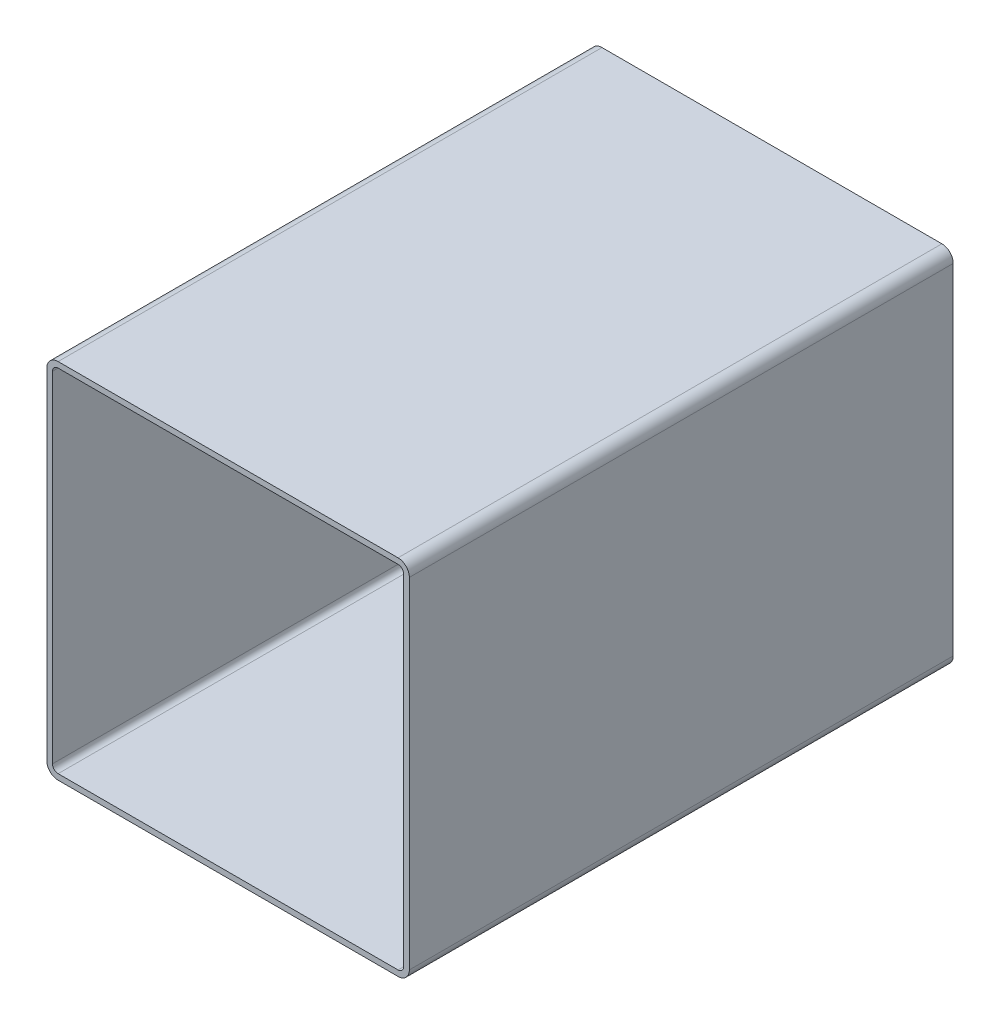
ISO-10303-21;
HEADER;
FILE_DESCRIPTION(('STEP AP214'),'2;1');
FILE_NAME('part.step','',(''),(''),'','','');
FILE_SCHEMA(('AUTOMOTIVE_DESIGN { 1 0 10303 214 1 1 1 1 }'));
ENDSEC;
DATA;
#1=APPLICATION_CONTEXT('core data for automotive mechanical design processes');
#2=APPLICATION_PROTOCOL_DEFINITION('international standard','automotive_design',2000,#1);
#3=PRODUCT_CONTEXT('',#1,'mechanical');
#4=PRODUCT('Part','Part','',(#3));
#5=PRODUCT_RELATED_PRODUCT_CATEGORY('part','',(#4));
#6=PRODUCT_DEFINITION_FORMATION('','',#4);
#7=PRODUCT_DEFINITION_CONTEXT('part definition',#1,'design');
#8=PRODUCT_DEFINITION('design','',#6,#7);
#9=PRODUCT_DEFINITION_SHAPE('','',#8);
#10=(LENGTH_UNIT() NAMED_UNIT(*) SI_UNIT(.MILLI.,.METRE.));
#11=(NAMED_UNIT(*) PLANE_ANGLE_UNIT() SI_UNIT($,.RADIAN.));
#12=(NAMED_UNIT(*) SI_UNIT($,.STERADIAN.) SOLID_ANGLE_UNIT());
#13=UNCERTAINTY_MEASURE_WITH_UNIT(LENGTH_MEASURE(1.E-05),#10,'distance_accuracy_value','');
#14=(GEOMETRIC_REPRESENTATION_CONTEXT(3) GLOBAL_UNCERTAINTY_ASSIGNED_CONTEXT((#13)) GLOBAL_UNIT_ASSIGNED_CONTEXT((#10,
#11,#12)) REPRESENTATION_CONTEXT('',''));
#15=CARTESIAN_POINT('',(0.,0.,0.));
#16=DIRECTION('',(0.,0.,1.));
#17=DIRECTION('',(1.,0.,0.));
#18=AXIS2_PLACEMENT_3D('',#15,#16,#17);
#19=CARTESIAN_POINT('',(7.7409404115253,198.816130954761,304.8));
#20=DIRECTION('',(0.,0.,1.));
#21=DIRECTION('',(1.,0.,0.));
#22=AXIS2_PLACEMENT_3D('',#19,#20,#21);
#23=PLANE('',#22);
#24=CARTESIAN_POINT('',(7.7409404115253,198.816130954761,304.8));
#25=DIRECTION('',(0.,0.,1.));
#26=DIRECTION('',(1.,0.,0.));
#27=AXIS2_PLACEMENT_3D('',#24,#25,#26);
#28=CIRCLE('',#27,6.35);
#29=CARTESIAN_POINT('',(7.7409404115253,205.166130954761,304.8));
#30=VERTEX_POINT('',#29);
#31=CARTESIAN_POINT('',(1.3909404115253,198.816130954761,304.8));
#32=VERTEX_POINT('',#31);
#33=EDGE_CURVE('E211',#30,#32,#28,.T.);
#34=ORIENTED_EDGE('',*,*,#33,.T.);
#35=DIRECTION('',(0.,-1.,0.));
#36=VECTOR('',#35,1.);
#37=CARTESIAN_POINT('',(1.3909404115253,8.31613095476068,304.8));
#38=LINE('',#37,#36);
#39=CARTESIAN_POINT('',(1.3909404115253,8.31613095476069,304.8));
#40=VERTEX_POINT('',#39);
#41=EDGE_CURVE('E214',#32,#40,#38,.T.);
#42=ORIENTED_EDGE('',*,*,#41,.T.);
#43=CARTESIAN_POINT('',(7.7409404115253,8.31613095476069,304.8));
#44=DIRECTION('',(0.,0.,1.));
#45=DIRECTION('',(1.,0.,0.));
#46=AXIS2_PLACEMENT_3D('',#43,#44,#45);
#47=CIRCLE('',#46,6.35);
#48=CARTESIAN_POINT('',(7.7409404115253,1.96613095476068,304.8));
#49=VERTEX_POINT('',#48);
#50=EDGE_CURVE('E217',#40,#49,#47,.T.);
#51=ORIENTED_EDGE('',*,*,#50,.T.);
#52=DIRECTION('',(1.,0.,0.));
#53=VECTOR('',#52,1.);
#54=CARTESIAN_POINT('',(198.240940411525,1.96613095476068,304.8));
#55=LINE('',#54,#53);
#56=CARTESIAN_POINT('',(198.240940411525,1.96613095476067,304.8));
#57=VERTEX_POINT('',#56);
#58=EDGE_CURVE('E219',#49,#57,#55,.T.);
#59=ORIENTED_EDGE('',*,*,#58,.T.);
#60=CARTESIAN_POINT('',(198.240940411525,8.31613095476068,304.8));
#61=DIRECTION('',(0.,0.,1.));
#62=DIRECTION('',(1.,0.,0.));
#63=AXIS2_PLACEMENT_3D('',#60,#61,#62);
#64=CIRCLE('',#63,6.35000000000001);
#65=CARTESIAN_POINT('',(204.590940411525,8.31613095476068,304.8));
#66=VERTEX_POINT('',#65);
#67=EDGE_CURVE('E221',#57,#66,#64,.T.);
#68=ORIENTED_EDGE('',*,*,#67,.T.);
#69=DIRECTION('',(0.,1.,0.));
#70=VECTOR('',#69,1.);
#71=CARTESIAN_POINT('',(204.590940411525,198.816130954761,304.8));
#72=LINE('',#71,#70);
#73=CARTESIAN_POINT('',(204.590940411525,198.816130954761,304.8));
#74=VERTEX_POINT('',#73);
#75=EDGE_CURVE('E223',#66,#74,#72,.T.);
#76=ORIENTED_EDGE('',*,*,#75,.T.);
#77=CARTESIAN_POINT('',(198.240940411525,198.816130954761,304.8));
#78=DIRECTION('',(0.,0.,1.));
#79=DIRECTION('',(1.,0.,0.));
#80=AXIS2_PLACEMENT_3D('',#77,#78,#79);
#81=CIRCLE('',#80,6.35000000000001);
#82=CARTESIAN_POINT('',(198.240940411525,205.166130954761,304.8));
#83=VERTEX_POINT('',#82);
#84=EDGE_CURVE('E225',#74,#83,#81,.T.);
#85=ORIENTED_EDGE('',*,*,#84,.T.);
#86=DIRECTION('',(-1.,0.,0.));
#87=VECTOR('',#86,1.);
#88=CARTESIAN_POINT('',(7.7409404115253,205.166130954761,304.8));
#89=LINE('',#88,#87);
#90=EDGE_CURVE('E227',#83,#30,#89,.T.);
#91=ORIENTED_EDGE('',*,*,#90,.T.);
#92=EDGE_LOOP('',(#34,#42,#51,#59,#68,#76,#85,#91));
#93=FACE_BOUND('',#92,.T.);
#94=DIRECTION('',(0.,-1.,0.));
#95=VECTOR('',#94,1.);
#96=CARTESIAN_POINT('',(4.5659404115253,8.31613095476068,304.8));
#97=LINE('',#96,#95);
#98=CARTESIAN_POINT('',(4.5659404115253,198.816130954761,304.8));
#99=VERTEX_POINT('',#98);
#100=CARTESIAN_POINT('',(4.5659404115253,8.31613095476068,304.8));
#101=VERTEX_POINT('',#100);
#102=EDGE_CURVE('E154',#99,#101,#97,.T.);
#103=ORIENTED_EDGE('',*,*,#102,.F.);
#104=CARTESIAN_POINT('',(7.7409404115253,198.816130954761,304.8));
#105=DIRECTION('',(0.,0.,1.));
#106=DIRECTION('',(1.,0.,0.));
#107=AXIS2_PLACEMENT_3D('',#104,#105,#106);
#108=CIRCLE('',#107,3.17499999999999);
#109=CARTESIAN_POINT('',(7.7409404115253,201.991130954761,304.8));
#110=VERTEX_POINT('',#109);
#111=EDGE_CURVE('E146',#110,#99,#108,.T.);
#112=ORIENTED_EDGE('',*,*,#111,.F.);
#113=DIRECTION('',(-1.,0.,0.));
#114=VECTOR('',#113,1.);
#115=CARTESIAN_POINT('',(7.7409404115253,201.991130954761,304.8));
#116=LINE('',#115,#114);
#117=CARTESIAN_POINT('',(198.240940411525,201.991130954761,304.8));
#118=VERTEX_POINT('',#117);
#119=EDGE_CURVE('E179',#118,#110,#116,.T.);
#120=ORIENTED_EDGE('',*,*,#119,.F.);
#121=CARTESIAN_POINT('',(198.240940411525,198.816130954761,304.8));
#122=DIRECTION('',(0.,0.,1.));
#123=DIRECTION('',(1.,0.,0.));
#124=AXIS2_PLACEMENT_3D('',#121,#122,#123);
#125=CIRCLE('',#124,3.175);
#126=CARTESIAN_POINT('',(201.415940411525,198.816130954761,304.8));
#127=VERTEX_POINT('',#126);
#128=EDGE_CURVE('E177',#127,#118,#125,.T.);
#129=ORIENTED_EDGE('',*,*,#128,.F.);
#130=DIRECTION('',(0.,1.,0.));
#131=VECTOR('',#130,1.);
#132=CARTESIAN_POINT('',(201.415940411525,198.816130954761,304.8));
#133=LINE('',#132,#131);
#134=CARTESIAN_POINT('',(201.415940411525,8.31613095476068,304.8));
#135=VERTEX_POINT('',#134);
#136=EDGE_CURVE('E175',#135,#127,#133,.T.);
#137=ORIENTED_EDGE('',*,*,#136,.F.);
#138=CARTESIAN_POINT('',(198.240940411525,8.31613095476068,304.8));
#139=DIRECTION('',(0.,0.,1.));
#140=DIRECTION('',(1.,0.,0.));
#141=AXIS2_PLACEMENT_3D('',#138,#139,#140);
#142=CIRCLE('',#141,3.175);
#143=CARTESIAN_POINT('',(198.240940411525,5.14113095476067,304.8));
#144=VERTEX_POINT('',#143);
#145=EDGE_CURVE('E173',#144,#135,#142,.T.);
#146=ORIENTED_EDGE('',*,*,#145,.F.);
#147=DIRECTION('',(1.,0.,0.));
#148=VECTOR('',#147,1.);
#149=CARTESIAN_POINT('',(198.240940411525,5.14113095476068,304.8));
#150=LINE('',#149,#148);
#151=CARTESIAN_POINT('',(7.7409404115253,5.14113095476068,304.8));
#152=VERTEX_POINT('',#151);
#153=EDGE_CURVE('E169',#152,#144,#150,.T.);
#154=ORIENTED_EDGE('',*,*,#153,.F.);
#155=CARTESIAN_POINT('',(7.7409404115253,8.31613095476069,304.8));
#156=DIRECTION('',(0.,0.,1.));
#157=DIRECTION('',(1.,0.,0.));
#158=AXIS2_PLACEMENT_3D('',#155,#156,#157);
#159=CIRCLE('',#158,3.175);
#160=EDGE_CURVE('E167',#101,#152,#159,.T.);
#161=ORIENTED_EDGE('',*,*,#160,.F.);
#162=EDGE_LOOP('',(#103,#112,#120,#129,#137,#146,#154,#161));
#163=FACE_BOUND('',#162,.T.);
#164=ADVANCED_FACE('F33',(#93,#163),#23,.T.);
#165=CARTESIAN_POINT('',(7.7409404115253,198.816130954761,0.));
#166=DIRECTION('',(0.,0.,1.));
#167=DIRECTION('',(1.,0.,0.));
#168=AXIS2_PLACEMENT_3D('',#165,#166,#167);
#169=PLANE('',#168);
#170=CARTESIAN_POINT('',(7.7409404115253,198.816130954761,0.));
#171=DIRECTION('',(0.,0.,1.));
#172=DIRECTION('',(1.,0.,0.));
#173=AXIS2_PLACEMENT_3D('',#170,#171,#172);
#174=CIRCLE('',#173,6.35);
#175=CARTESIAN_POINT('',(7.7409404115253,205.166130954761,0.));
#176=VERTEX_POINT('',#175);
#177=CARTESIAN_POINT('',(1.3909404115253,198.816130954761,0.));
#178=VERTEX_POINT('',#177);
#179=EDGE_CURVE('E162',#176,#178,#174,.T.);
#180=ORIENTED_EDGE('',*,*,#179,.F.);
#181=DIRECTION('',(-1.,0.,0.));
#182=VECTOR('',#181,1.);
#183=CARTESIAN_POINT('',(7.7409404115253,205.166130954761,0.));
#184=LINE('',#183,#182);
#185=CARTESIAN_POINT('',(198.240940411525,205.166130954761,0.));
#186=VERTEX_POINT('',#185);
#187=EDGE_CURVE('E215',#186,#176,#184,.T.);
#188=ORIENTED_EDGE('',*,*,#187,.F.);
#189=CARTESIAN_POINT('',(198.240940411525,198.816130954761,0.));
#190=DIRECTION('',(0.,0.,1.));
#191=DIRECTION('',(1.,0.,0.));
#192=AXIS2_PLACEMENT_3D('',#189,#190,#191);
#193=CIRCLE('',#192,6.35000000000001);
#194=CARTESIAN_POINT('',(204.590940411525,198.816130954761,0.));
#195=VERTEX_POINT('',#194);
#196=EDGE_CURVE('E242',#195,#186,#193,.T.);
#197=ORIENTED_EDGE('',*,*,#196,.F.);
#198=DIRECTION('',(0.,1.,0.));
#199=VECTOR('',#198,1.);
#200=CARTESIAN_POINT('',(204.590940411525,198.816130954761,0.));
#201=LINE('',#200,#199);
#202=CARTESIAN_POINT('',(204.590940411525,8.31613095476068,0.));
#203=VERTEX_POINT('',#202);
#204=EDGE_CURVE('E240',#203,#195,#201,.T.);
#205=ORIENTED_EDGE('',*,*,#204,.F.);
#206=CARTESIAN_POINT('',(198.240940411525,8.31613095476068,0.));
#207=DIRECTION('',(0.,0.,1.));
#208=DIRECTION('',(1.,0.,0.));
#209=AXIS2_PLACEMENT_3D('',#206,#207,#208);
#210=CIRCLE('',#209,6.35000000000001);
#211=CARTESIAN_POINT('',(198.240940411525,1.96613095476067,0.));
#212=VERTEX_POINT('',#211);
#213=EDGE_CURVE('E238',#212,#203,#210,.T.);
#214=ORIENTED_EDGE('',*,*,#213,.F.);
#215=DIRECTION('',(1.,0.,0.));
#216=VECTOR('',#215,1.);
#217=CARTESIAN_POINT('',(198.240940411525,1.96613095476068,0.));
#218=LINE('',#217,#216);
#219=CARTESIAN_POINT('',(7.7409404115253,1.96613095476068,0.));
#220=VERTEX_POINT('',#219);
#221=EDGE_CURVE('E236',#220,#212,#218,.T.);
#222=ORIENTED_EDGE('',*,*,#221,.F.);
#223=CARTESIAN_POINT('',(7.7409404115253,8.31613095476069,0.));
#224=DIRECTION('',(0.,0.,1.));
#225=DIRECTION('',(1.,0.,0.));
#226=AXIS2_PLACEMENT_3D('',#223,#224,#225);
#227=CIRCLE('',#226,6.35);
#228=CARTESIAN_POINT('',(1.3909404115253,8.31613095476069,0.));
#229=VERTEX_POINT('',#228);
#230=EDGE_CURVE('E234',#229,#220,#227,.T.);
#231=ORIENTED_EDGE('',*,*,#230,.F.);
#232=DIRECTION('',(0.,-1.,0.));
#233=VECTOR('',#232,1.);
#234=CARTESIAN_POINT('',(1.3909404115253,8.31613095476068,0.));
#235=LINE('',#234,#233);
#236=EDGE_CURVE('E232',#178,#229,#235,.T.);
#237=ORIENTED_EDGE('',*,*,#236,.F.);
#238=EDGE_LOOP('',(#180,#188,#197,#205,#214,#222,#231,#237));
#239=FACE_BOUND('',#238,.T.);
#240=CARTESIAN_POINT('',(7.7409404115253,198.816130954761,0.));
#241=DIRECTION('',(0.,0.,1.));
#242=DIRECTION('',(1.,0.,0.));
#243=AXIS2_PLACEMENT_3D('',#240,#241,#242);
#244=CIRCLE('',#243,3.17499999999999);
#245=CARTESIAN_POINT('',(7.7409404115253,201.991130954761,0.));
#246=VERTEX_POINT('',#245);
#247=CARTESIAN_POINT('',(4.5659404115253,198.816130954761,0.));
#248=VERTEX_POINT('',#247);
#249=EDGE_CURVE('E56',#246,#248,#244,.T.);
#250=ORIENTED_EDGE('',*,*,#249,.T.);
#251=DIRECTION('',(0.,-1.,0.));
#252=VECTOR('',#251,1.);
#253=CARTESIAN_POINT('',(4.5659404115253,8.31613095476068,0.));
#254=LINE('',#253,#252);
#255=CARTESIAN_POINT('',(4.5659404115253,8.31613095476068,0.));
#256=VERTEX_POINT('',#255);
#257=EDGE_CURVE('E161',#248,#256,#254,.T.);
#258=ORIENTED_EDGE('',*,*,#257,.T.);
#259=CARTESIAN_POINT('',(7.7409404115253,8.31613095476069,0.));
#260=DIRECTION('',(0.,0.,1.));
#261=DIRECTION('',(1.,0.,0.));
#262=AXIS2_PLACEMENT_3D('',#259,#260,#261);
#263=CIRCLE('',#262,3.175);
#264=CARTESIAN_POINT('',(7.7409404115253,5.14113095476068,0.));
#265=VERTEX_POINT('',#264);
#266=EDGE_CURVE('E183',#256,#265,#263,.T.);
#267=ORIENTED_EDGE('',*,*,#266,.T.);
#268=DIRECTION('',(1.,0.,0.));
#269=VECTOR('',#268,1.);
#270=CARTESIAN_POINT('',(198.240940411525,5.14113095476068,0.));
#271=LINE('',#270,#269);
#272=CARTESIAN_POINT('',(198.240940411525,5.14113095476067,0.));
#273=VERTEX_POINT('',#272);
#274=EDGE_CURVE('E186',#265,#273,#271,.T.);
#275=ORIENTED_EDGE('',*,*,#274,.T.);
#276=CARTESIAN_POINT('',(198.240940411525,8.31613095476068,0.));
#277=DIRECTION('',(0.,0.,1.));
#278=DIRECTION('',(1.,0.,0.));
#279=AXIS2_PLACEMENT_3D('',#276,#277,#278);
#280=CIRCLE('',#279,3.175);
#281=CARTESIAN_POINT('',(201.415940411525,8.31613095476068,0.));
#282=VERTEX_POINT('',#281);
#283=EDGE_CURVE('E189',#273,#282,#280,.T.);
#284=ORIENTED_EDGE('',*,*,#283,.T.);
#285=DIRECTION('',(0.,1.,0.));
#286=VECTOR('',#285,1.);
#287=CARTESIAN_POINT('',(201.415940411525,198.816130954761,0.));
#288=LINE('',#287,#286);
#289=CARTESIAN_POINT('',(201.415940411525,198.816130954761,0.));
#290=VERTEX_POINT('',#289);
#291=EDGE_CURVE('E192',#282,#290,#288,.T.);
#292=ORIENTED_EDGE('',*,*,#291,.T.);
#293=CARTESIAN_POINT('',(198.240940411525,198.816130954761,0.));
#294=DIRECTION('',(0.,0.,1.));
#295=DIRECTION('',(1.,0.,0.));
#296=AXIS2_PLACEMENT_3D('',#293,#294,#295);
#297=CIRCLE('',#296,3.175);
#298=CARTESIAN_POINT('',(198.240940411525,201.991130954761,0.));
#299=VERTEX_POINT('',#298);
#300=EDGE_CURVE('E195',#290,#299,#297,.T.);
#301=ORIENTED_EDGE('',*,*,#300,.T.);
#302=DIRECTION('',(-1.,0.,0.));
#303=VECTOR('',#302,1.);
#304=CARTESIAN_POINT('',(7.7409404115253,201.991130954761,0.));
#305=LINE('',#304,#303);
#306=EDGE_CURVE('E155',#299,#246,#305,.T.);
#307=ORIENTED_EDGE('',*,*,#306,.T.);
#308=EDGE_LOOP('',(#250,#258,#267,#275,#284,#292,#301,#307));
#309=FACE_BOUND('',#308,.T.);
#310=ADVANCED_FACE('F272',(#239,#309),#169,.F.);
#311=CARTESIAN_POINT('',(7.7409404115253,198.816130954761,304.8));
#312=DIRECTION('',(0.,0.,-1.));
#313=DIRECTION('',(-1.,0.,0.));
#314=AXIS2_PLACEMENT_3D('',#311,#312,#313);
#315=CYLINDRICAL_SURFACE('',#314,6.35);
#316=ORIENTED_EDGE('',*,*,#179,.T.);
#317=DIRECTION('',(0.,0.,-1.));
#318=VECTOR('',#317,1.);
#319=CARTESIAN_POINT('',(1.3909404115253,198.816130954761,304.8));
#320=LINE('',#319,#318);
#321=EDGE_CURVE('E11',#32,#178,#320,.T.);
#322=ORIENTED_EDGE('',*,*,#321,.F.);
#323=ORIENTED_EDGE('',*,*,#33,.F.);
#324=DIRECTION('',(0.,0.,-1.));
#325=VECTOR('',#324,1.);
#326=CARTESIAN_POINT('',(7.7409404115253,205.166130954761,304.8));
#327=LINE('',#326,#325);
#328=EDGE_CURVE('E229',#30,#176,#327,.T.);
#329=ORIENTED_EDGE('',*,*,#328,.T.);
#330=EDGE_LOOP('',(#316,#322,#323,#329));
#331=FACE_BOUND('',#330,.T.);
#332=ADVANCED_FACE('F35',(#331),#315,.T.);
#333=CARTESIAN_POINT('',(1.3909404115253,8.31613095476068,304.8));
#334=DIRECTION('',(1.,0.,0.));
#335=DIRECTION('',(0.,0.,-1.));
#336=AXIS2_PLACEMENT_3D('',#333,#334,#335);
#337=PLANE('',#336);
#338=ORIENTED_EDGE('',*,*,#236,.T.);
#339=DIRECTION('',(0.,0.,-1.));
#340=VECTOR('',#339,1.);
#341=CARTESIAN_POINT('',(1.3909404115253,8.31613095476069,304.8));
#342=LINE('',#341,#340);
#343=EDGE_CURVE('E41',#40,#229,#342,.T.);
#344=ORIENTED_EDGE('',*,*,#343,.F.);
#345=ORIENTED_EDGE('',*,*,#41,.F.);
#346=ORIENTED_EDGE('',*,*,#321,.T.);
#347=EDGE_LOOP('',(#338,#344,#345,#346));
#348=FACE_BOUND('',#347,.T.);
#349=ADVANCED_FACE('F289',(#348),#337,.F.);
#350=CARTESIAN_POINT('',(7.7409404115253,8.31613095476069,304.8));
#351=DIRECTION('',(0.,0.,-1.));
#352=DIRECTION('',(-1.,0.,0.));
#353=AXIS2_PLACEMENT_3D('',#350,#351,#352);
#354=CYLINDRICAL_SURFACE('',#353,6.35);
#355=ORIENTED_EDGE('',*,*,#230,.T.);
#356=DIRECTION('',(0.,0.,-1.));
#357=VECTOR('',#356,1.);
#358=CARTESIAN_POINT('',(7.7409404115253,1.96613095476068,304.8));
#359=LINE('',#358,#357);
#360=EDGE_CURVE('E259',#49,#220,#359,.T.);
#361=ORIENTED_EDGE('',*,*,#360,.F.);
#362=ORIENTED_EDGE('',*,*,#50,.F.);
#363=ORIENTED_EDGE('',*,*,#343,.T.);
#364=EDGE_LOOP('',(#355,#361,#362,#363));
#365=FACE_BOUND('',#364,.T.);
#366=ADVANCED_FACE('F266',(#365),#354,.T.);
#367=CARTESIAN_POINT('',(198.240940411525,1.96613095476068,304.8));
#368=DIRECTION('',(0.,1.,0.));
#369=DIRECTION('',(0.,0.,1.));
#370=AXIS2_PLACEMENT_3D('',#367,#368,#369);
#371=PLANE('',#370);
#372=ORIENTED_EDGE('',*,*,#221,.T.);
#373=DIRECTION('',(0.,0.,-1.));
#374=VECTOR('',#373,1.);
#375=CARTESIAN_POINT('',(198.240940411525,1.96613095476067,304.8));
#376=LINE('',#375,#374);
#377=EDGE_CURVE('E256',#57,#212,#376,.T.);
#378=ORIENTED_EDGE('',*,*,#377,.F.);
#379=ORIENTED_EDGE('',*,*,#58,.F.);
#380=ORIENTED_EDGE('',*,*,#360,.T.);
#381=EDGE_LOOP('',(#372,#378,#379,#380));
#382=FACE_BOUND('',#381,.T.);
#383=ADVANCED_FACE('F278',(#382),#371,.F.);
#384=CARTESIAN_POINT('',(198.240940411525,8.31613095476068,304.8));
#385=DIRECTION('',(0.,0.,-1.));
#386=DIRECTION('',(-1.,0.,0.));
#387=AXIS2_PLACEMENT_3D('',#384,#385,#386);
#388=CYLINDRICAL_SURFACE('',#387,6.35000000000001);
#389=ORIENTED_EDGE('',*,*,#213,.T.);
#390=DIRECTION('',(0.,0.,-1.));
#391=VECTOR('',#390,1.);
#392=CARTESIAN_POINT('',(204.590940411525,8.31613095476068,304.8));
#393=LINE('',#392,#391);
#394=EDGE_CURVE('E253',#66,#203,#393,.T.);
#395=ORIENTED_EDGE('',*,*,#394,.F.);
#396=ORIENTED_EDGE('',*,*,#67,.F.);
#397=ORIENTED_EDGE('',*,*,#377,.T.);
#398=EDGE_LOOP('',(#389,#395,#396,#397));
#399=FACE_BOUND('',#398,.T.);
#400=ADVANCED_FACE('F282',(#399),#388,.T.);
#401=CARTESIAN_POINT('',(204.590940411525,198.816130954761,304.8));
#402=DIRECTION('',(-1.,0.,0.));
#403=DIRECTION('',(0.,0.,1.));
#404=AXIS2_PLACEMENT_3D('',#401,#402,#403);
#405=PLANE('',#404);
#406=ORIENTED_EDGE('',*,*,#204,.T.);
#407=DIRECTION('',(0.,0.,-1.));
#408=VECTOR('',#407,1.);
#409=CARTESIAN_POINT('',(204.590940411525,198.816130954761,304.8));
#410=LINE('',#409,#408);
#411=EDGE_CURVE('E250',#74,#195,#410,.T.);
#412=ORIENTED_EDGE('',*,*,#411,.F.);
#413=ORIENTED_EDGE('',*,*,#75,.F.);
#414=ORIENTED_EDGE('',*,*,#394,.T.);
#415=EDGE_LOOP('',(#406,#412,#413,#414));
#416=FACE_BOUND('',#415,.T.);
#417=ADVANCED_FACE('F302',(#416),#405,.F.);
#418=CARTESIAN_POINT('',(198.240940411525,198.816130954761,304.8));
#419=DIRECTION('',(0.,0.,-1.));
#420=DIRECTION('',(-1.,0.,0.));
#421=AXIS2_PLACEMENT_3D('',#418,#419,#420);
#422=CYLINDRICAL_SURFACE('',#421,6.35000000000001);
#423=ORIENTED_EDGE('',*,*,#196,.T.);
#424=DIRECTION('',(0.,0.,-1.));
#425=VECTOR('',#424,1.);
#426=CARTESIAN_POINT('',(198.240940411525,205.166130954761,304.8));
#427=LINE('',#426,#425);
#428=EDGE_CURVE('E247',#83,#186,#427,.T.);
#429=ORIENTED_EDGE('',*,*,#428,.F.);
#430=ORIENTED_EDGE('',*,*,#84,.F.);
#431=ORIENTED_EDGE('',*,*,#411,.T.);
#432=EDGE_LOOP('',(#423,#429,#430,#431));
#433=FACE_BOUND('',#432,.T.);
#434=ADVANCED_FACE('F300',(#433),#422,.T.);
#435=CARTESIAN_POINT('',(7.7409404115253,205.166130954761,304.8));
#436=DIRECTION('',(0.,-1.,0.));
#437=DIRECTION('',(0.,0.,-1.));
#438=AXIS2_PLACEMENT_3D('',#435,#436,#437);
#439=PLANE('',#438);
#440=ORIENTED_EDGE('',*,*,#187,.T.);
#441=ORIENTED_EDGE('',*,*,#328,.F.);
#442=ORIENTED_EDGE('',*,*,#90,.F.);
#443=ORIENTED_EDGE('',*,*,#428,.T.);
#444=EDGE_LOOP('',(#440,#441,#442,#443));
#445=FACE_BOUND('',#444,.T.);
#446=ADVANCED_FACE('F295',(#445),#439,.F.);
#447=CARTESIAN_POINT('',(7.7409404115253,198.816130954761,304.8));
#448=DIRECTION('',(0.,0.,-1.));
#449=DIRECTION('',(-1.,0.,0.));
#450=AXIS2_PLACEMENT_3D('',#447,#448,#449);
#451=CYLINDRICAL_SURFACE('',#450,3.17499999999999);
#452=ORIENTED_EDGE('',*,*,#249,.F.);
#453=DIRECTION('',(0.,0.,-1.));
#454=VECTOR('',#453,1.);
#455=CARTESIAN_POINT('',(7.7409404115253,201.991130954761,304.8));
#456=LINE('',#455,#454);
#457=EDGE_CURVE('E150',#110,#246,#456,.T.);
#458=ORIENTED_EDGE('',*,*,#457,.F.);
#459=ORIENTED_EDGE('',*,*,#111,.T.);
#460=DIRECTION('',(0.,0.,-1.));
#461=VECTOR('',#460,1.);
#462=CARTESIAN_POINT('',(4.5659404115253,198.816130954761,304.8));
#463=LINE('',#462,#461);
#464=EDGE_CURVE('E149',#99,#248,#463,.T.);
#465=ORIENTED_EDGE('',*,*,#464,.T.);
#466=EDGE_LOOP('',(#452,#458,#459,#465));
#467=FACE_BOUND('',#466,.T.);
#468=ADVANCED_FACE('F148',(#467),#451,.F.);
#469=CARTESIAN_POINT('',(4.5659404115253,8.31613095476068,304.8));
#470=DIRECTION('',(1.,0.,0.));
#471=DIRECTION('',(0.,0.,-1.));
#472=AXIS2_PLACEMENT_3D('',#469,#470,#471);
#473=PLANE('',#472);
#474=ORIENTED_EDGE('',*,*,#257,.F.);
#475=ORIENTED_EDGE('',*,*,#464,.F.);
#476=ORIENTED_EDGE('',*,*,#102,.T.);
#477=DIRECTION('',(0.,0.,-1.));
#478=VECTOR('',#477,1.);
#479=CARTESIAN_POINT('',(4.5659404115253,8.31613095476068,304.8));
#480=LINE('',#479,#478);
#481=EDGE_CURVE('E163',#101,#256,#480,.T.);
#482=ORIENTED_EDGE('',*,*,#481,.T.);
#483=EDGE_LOOP('',(#474,#475,#476,#482));
#484=FACE_BOUND('',#483,.T.);
#485=ADVANCED_FACE('F158',(#484),#473,.T.);
#486=CARTESIAN_POINT('',(7.7409404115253,8.31613095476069,304.8));
#487=DIRECTION('',(0.,0.,-1.));
#488=DIRECTION('',(-1.,0.,0.));
#489=AXIS2_PLACEMENT_3D('',#486,#487,#488);
#490=CYLINDRICAL_SURFACE('',#489,3.175);
#491=ORIENTED_EDGE('',*,*,#266,.F.);
#492=ORIENTED_EDGE('',*,*,#481,.F.);
#493=ORIENTED_EDGE('',*,*,#160,.T.);
#494=DIRECTION('',(0.,0.,-1.));
#495=VECTOR('',#494,1.);
#496=CARTESIAN_POINT('',(7.7409404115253,5.14113095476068,304.8));
#497=LINE('',#496,#495);
#498=EDGE_CURVE('E208',#152,#265,#497,.T.);
#499=ORIENTED_EDGE('',*,*,#498,.T.);
#500=EDGE_LOOP('',(#491,#492,#493,#499));
#501=FACE_BOUND('',#500,.T.);
#502=ADVANCED_FACE('F327',(#501),#490,.F.);
#503=CARTESIAN_POINT('',(198.240940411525,5.14113095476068,304.8));
#504=DIRECTION('',(0.,1.,0.));
#505=DIRECTION('',(0.,0.,1.));
#506=AXIS2_PLACEMENT_3D('',#503,#504,#505);
#507=PLANE('',#506);
#508=ORIENTED_EDGE('',*,*,#274,.F.);
#509=ORIENTED_EDGE('',*,*,#498,.F.);
#510=ORIENTED_EDGE('',*,*,#153,.T.);
#511=DIRECTION('',(0.,0.,-1.));
#512=VECTOR('',#511,1.);
#513=CARTESIAN_POINT('',(198.240940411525,5.14113095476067,304.8));
#514=LINE('',#513,#512);
#515=EDGE_CURVE('E206',#144,#273,#514,.T.);
#516=ORIENTED_EDGE('',*,*,#515,.T.);
#517=EDGE_LOOP('',(#508,#509,#510,#516));
#518=FACE_BOUND('',#517,.T.);
#519=ADVANCED_FACE('F331',(#518),#507,.T.);
#520=CARTESIAN_POINT('',(198.240940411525,8.31613095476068,304.8));
#521=DIRECTION('',(0.,0.,-1.));
#522=DIRECTION('',(-1.,0.,0.));
#523=AXIS2_PLACEMENT_3D('',#520,#521,#522);
#524=CYLINDRICAL_SURFACE('',#523,3.175);
#525=ORIENTED_EDGE('',*,*,#283,.F.);
#526=ORIENTED_EDGE('',*,*,#515,.F.);
#527=ORIENTED_EDGE('',*,*,#145,.T.);
#528=DIRECTION('',(0.,0.,-1.));
#529=VECTOR('',#528,1.);
#530=CARTESIAN_POINT('',(201.415940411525,8.31613095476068,304.8));
#531=LINE('',#530,#529);
#532=EDGE_CURVE('E204',#135,#282,#531,.T.);
#533=ORIENTED_EDGE('',*,*,#532,.T.);
#534=EDGE_LOOP('',(#525,#526,#527,#533));
#535=FACE_BOUND('',#534,.T.);
#536=ADVANCED_FACE('F337',(#535),#524,.F.);
#537=CARTESIAN_POINT('',(201.415940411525,198.816130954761,304.8));
#538=DIRECTION('',(-1.,0.,0.));
#539=DIRECTION('',(0.,0.,1.));
#540=AXIS2_PLACEMENT_3D('',#537,#538,#539);
#541=PLANE('',#540);
#542=ORIENTED_EDGE('',*,*,#291,.F.);
#543=ORIENTED_EDGE('',*,*,#532,.F.);
#544=ORIENTED_EDGE('',*,*,#136,.T.);
#545=DIRECTION('',(0.,0.,-1.));
#546=VECTOR('',#545,1.);
#547=CARTESIAN_POINT('',(201.415940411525,198.816130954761,304.8));
#548=LINE('',#547,#546);
#549=EDGE_CURVE('E202',#127,#290,#548,.T.);
#550=ORIENTED_EDGE('',*,*,#549,.T.);
#551=EDGE_LOOP('',(#542,#543,#544,#550));
#552=FACE_BOUND('',#551,.T.);
#553=ADVANCED_FACE('F341',(#552),#541,.T.);
#554=CARTESIAN_POINT('',(198.240940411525,198.816130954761,304.8));
#555=DIRECTION('',(0.,0.,-1.));
#556=DIRECTION('',(-1.,0.,0.));
#557=AXIS2_PLACEMENT_3D('',#554,#555,#556);
#558=CYLINDRICAL_SURFACE('',#557,3.175);
#559=ORIENTED_EDGE('',*,*,#300,.F.);
#560=ORIENTED_EDGE('',*,*,#549,.F.);
#561=ORIENTED_EDGE('',*,*,#128,.T.);
#562=DIRECTION('',(0.,0.,-1.));
#563=VECTOR('',#562,1.);
#564=CARTESIAN_POINT('',(198.240940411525,201.991130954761,304.8));
#565=LINE('',#564,#563);
#566=EDGE_CURVE('E48',#118,#299,#565,.T.);
#567=ORIENTED_EDGE('',*,*,#566,.T.);
#568=EDGE_LOOP('',(#559,#560,#561,#567));
#569=FACE_BOUND('',#568,.T.);
#570=ADVANCED_FACE('F345',(#569),#558,.F.);
#571=CARTESIAN_POINT('',(7.7409404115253,201.991130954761,304.8));
#572=DIRECTION('',(0.,-1.,0.));
#573=DIRECTION('',(0.,0.,-1.));
#574=AXIS2_PLACEMENT_3D('',#571,#572,#573);
#575=PLANE('',#574);
#576=ORIENTED_EDGE('',*,*,#306,.F.);
#577=ORIENTED_EDGE('',*,*,#566,.F.);
#578=ORIENTED_EDGE('',*,*,#119,.T.);
#579=ORIENTED_EDGE('',*,*,#457,.T.);
#580=EDGE_LOOP('',(#576,#577,#578,#579));
#581=FACE_BOUND('',#580,.T.);
#582=ADVANCED_FACE('F349',(#581),#575,.T.);
#583=CLOSED_SHELL('',(#164,#310,#332,#349,#366,#383,#400,#417,#434,#446,#468,#485,#502,#519,
#536,#553,#570,#582));
#584=MANIFOLD_SOLID_BREP('B2',#583);
#585=ADVANCED_BREP_SHAPE_REPRESENTATION('',(#18,#584),#14);
#586=SHAPE_DEFINITION_REPRESENTATION(#9,#585);
ENDSEC;
END-ISO-10303-21;
